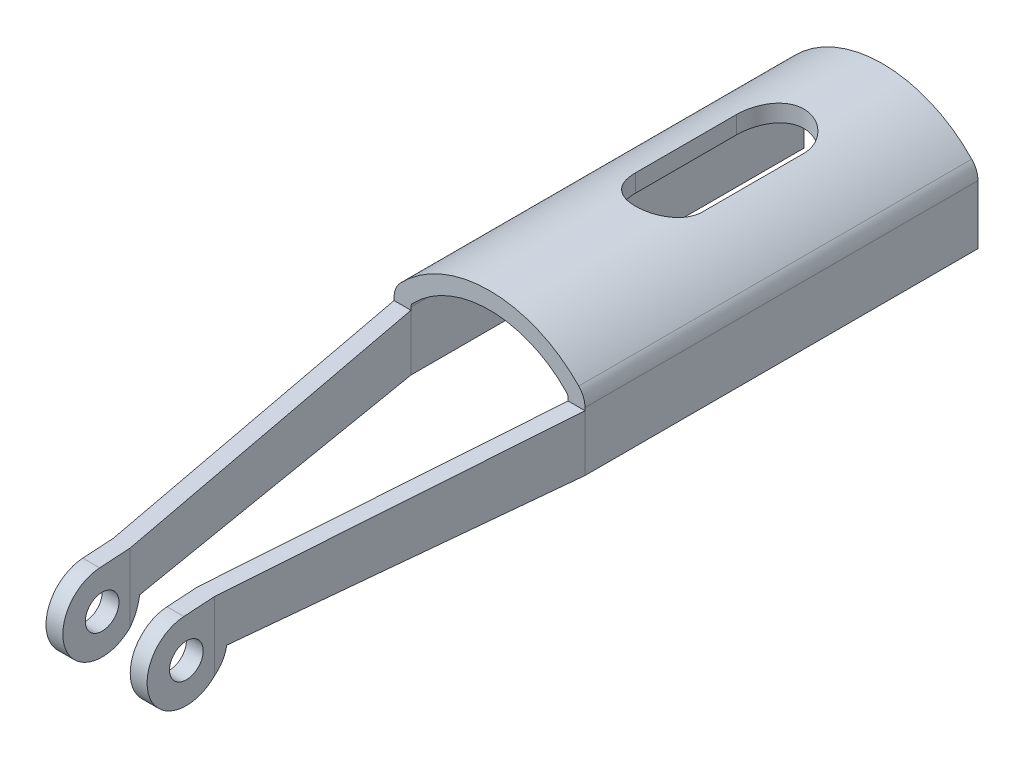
from build123d import *

# Parameters (mm, degrees)
BASE_EXTRUSION_DEPTH    = 35
BOSS_EXTRU_1_DEPTH      = 4
BOSS_EXTRU_1_DEPTH_BACK = 5
ENL_V_MAT_EXTRU_1_DEPTH = 73.869746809
ESQUISSE5_R             = 1.5
ENL_V_MAT_EXTRU_2_DEPTH = 73.041654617
ENL_V_MAT_EXTRU_3_DEPTH = 72.22224315


with BuildPart() as part:
    # Esquisse1 → Base-Extrusion (new body)
    with BuildSketch(Plane.XY):
        with BuildLine():
            Line((-8.5, 6.224949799), (-8.5, 0.982120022))
            Line((-8.5, 0.982120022), (-7, 0.982120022))
            Line((-7, 0.982120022), (-7, 6.224949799))
            ThreePointArc((-7, 6.224949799), (-6.963980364, 6.411288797), (-6.861111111, 6.570780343))
            ThreePointArc((-6.861111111, 6.570780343), (0, 9.5), (6.861111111, 6.570780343))
            ThreePointArc((6.861111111, 6.570780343), (6.963980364, 6.411288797), (7, 6.224949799))
            Line((7, 6.224949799), (7, 0.982120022))
            Line((7, 0.982120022), (8.5, 0.982120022))
            Line((8.5, 0.982120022), (8.5, 6.224949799))
            ThreePointArc((8.5, 6.224949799), (8.355921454, 6.970305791), (7.944444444, 7.608271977))
            ThreePointArc((7.944444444, 7.608271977), (0, 11), (-7.944444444, 7.608271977))
            ThreePointArc((-7.944444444, 7.608271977), (-8.355921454, 6.970305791), (-8.5, 6.224949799))
        make_face()
    extrude(amount=BASE_EXTRUSION_DEPTH)

    # Esquisse2 → Boss.-Extru.1 (add, two sides: drawn at the far end of the back side and taken through both)
    with BuildSketch(Plane.XZ.offset(-0.982120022).offset(-BOSS_EXTRU_1_DEPTH_BACK)):
        Polygon((7, 35), (8.5, 35), (4.5, 64), (4.5, 70), (3, 70), (3, 64), align=None)
        Polygon((-7, 35), (-3, 64), (-3, 70), (-4.5, 70), (-4.5, 64), (-8.5, 35), align=None)
    extrude(amount=BOSS_EXTRU_1_DEPTH + BOSS_EXTRU_1_DEPTH_BACK)

    # Esquisse4 → Enl_v. mat.-Extru.1 (cut, through all)
    with BuildSketch(Plane(origin=(8.5, 0, 0), x_dir=(0, 0, -1), z_dir=(1, 0, 0))):
        with BuildLine():
            Line((-35, 5.982120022), (-66.721002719, 3.975135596))
            ThreePointArc((-66.721002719, 3.975135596), (-69.072054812, -1.891597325), (-63.035898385, -0.017879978))
            Line((-63.035898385, -0.017879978), (-35, 0.982120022))
            Line((-35, 0.982120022), (-35, -4.017879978))
            Line((-35, -4.017879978), (-75, -4.017879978))
            Line((-75, -4.017879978), (-75, 11))
            Line((-75, 11), (-35, 11))
            Line((-35, 11), (-35, 5.982120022))
        make_face()
    extrude(amount=-ENL_V_MAT_EXTRU_1_DEPTH, mode=Mode.SUBTRACT)

    # Esquisse5 → Enl_v. mat.-Extru.2 (cut, through all)
    with BuildSketch(Plane(origin=(4.5, 0, 0), x_dir=(0, 0, -1), z_dir=(1, 0, 0))):
        with Locations((-66.5, 0.482120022)):
            Circle(ESQUISSE5_R)
    extrude(amount=-ENL_V_MAT_EXTRU_2_DEPTH, mode=Mode.SUBTRACT)

    # Esquisse6 → Enl_v. mat.-Extru.3 (cut, through all)
    with BuildSketch(Plane.XZ.offset(-0.982120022)):
        with BuildLine():
            Line((3, 19), (3, 10))
            ThreePointArc((3, 10), (0, 7), (-3, 10))
            Line((-3, 10), (-3, 19))
            ThreePointArc((-3, 19), (0, 22), (3, 19))
        make_face()
    extrude(amount=-ENL_V_MAT_EXTRU_3_DEPTH, mode=Mode.SUBTRACT)


solid = part.part
